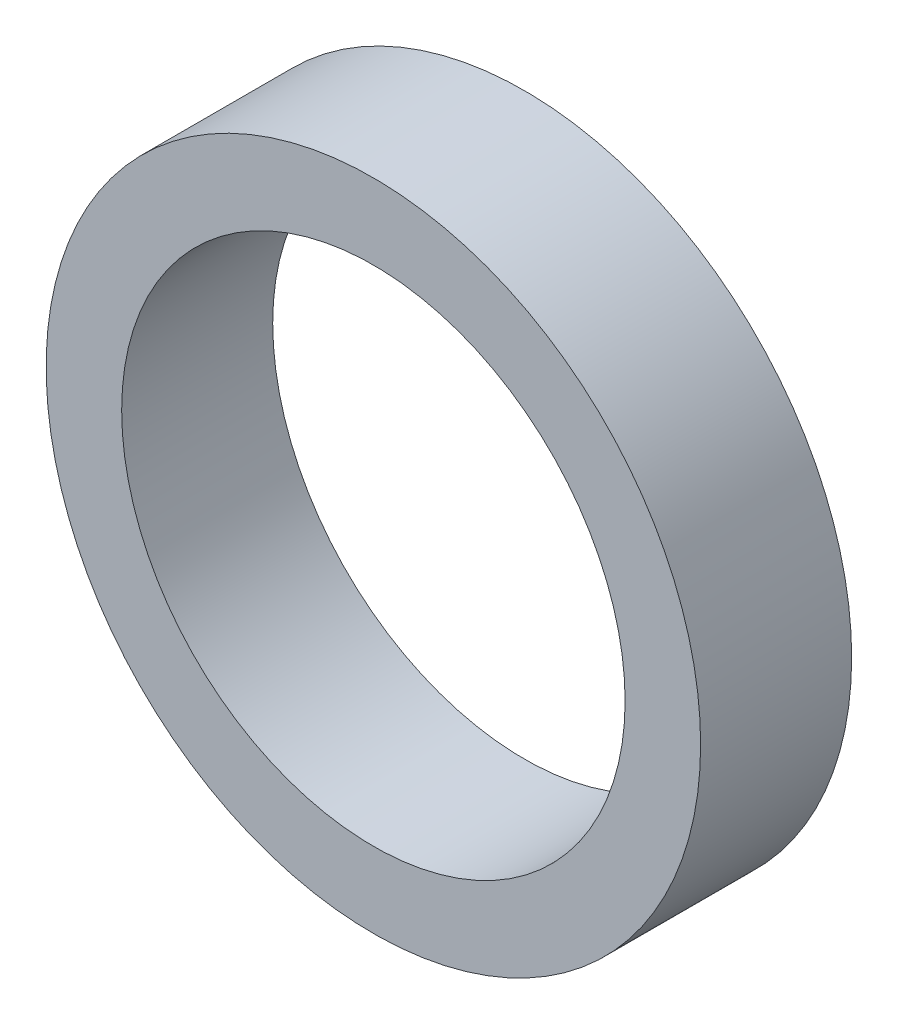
ISO-10303-21;
HEADER;
FILE_DESCRIPTION(('STEP AP214'),'2;1');
FILE_NAME('part.step','',(''),(''),'','','');
FILE_SCHEMA(('AUTOMOTIVE_DESIGN { 1 0 10303 214 1 1 1 1 }'));
ENDSEC;
DATA;
#1=APPLICATION_CONTEXT('core data for automotive mechanical design processes');
#2=APPLICATION_PROTOCOL_DEFINITION('international standard','automotive_design',2000,#1);
#3=PRODUCT_CONTEXT('',#1,'mechanical');
#4=PRODUCT('Part','Part','',(#3));
#5=PRODUCT_RELATED_PRODUCT_CATEGORY('part','',(#4));
#6=PRODUCT_DEFINITION_FORMATION('','',#4);
#7=PRODUCT_DEFINITION_CONTEXT('part definition',#1,'design');
#8=PRODUCT_DEFINITION('design','',#6,#7);
#9=PRODUCT_DEFINITION_SHAPE('','',#8);
#10=(LENGTH_UNIT() NAMED_UNIT(*) SI_UNIT(.MILLI.,.METRE.));
#11=(NAMED_UNIT(*) PLANE_ANGLE_UNIT() SI_UNIT($,.RADIAN.));
#12=(NAMED_UNIT(*) SI_UNIT($,.STERADIAN.) SOLID_ANGLE_UNIT());
#13=UNCERTAINTY_MEASURE_WITH_UNIT(LENGTH_MEASURE(1.E-05),#10,'distance_accuracy_value','');
#14=(GEOMETRIC_REPRESENTATION_CONTEXT(3) GLOBAL_UNCERTAINTY_ASSIGNED_CONTEXT((#13)) GLOBAL_UNIT_ASSIGNED_CONTEXT((#10,
#11,#12)) REPRESENTATION_CONTEXT('',''));
#15=CARTESIAN_POINT('',(0.,0.,0.));
#16=DIRECTION('',(0.,0.,1.));
#17=DIRECTION('',(1.,0.,0.));
#18=AXIS2_PLACEMENT_3D('',#15,#16,#17);
#19=CARTESIAN_POINT('',(0.,0.,-3.));
#20=DIRECTION('',(0.,0.,1.));
#21=DIRECTION('',(1.,0.,0.));
#22=AXIS2_PLACEMENT_3D('',#19,#20,#21);
#23=CYLINDRICAL_SURFACE('',#22,6.5);
#24=CARTESIAN_POINT('',(0.,0.,-3.));
#25=DIRECTION('',(0.,0.,1.));
#26=DIRECTION('',(1.,0.,0.));
#27=AXIS2_PLACEMENT_3D('',#24,#25,#26);
#28=CIRCLE('',#27,6.5);
#29=CARTESIAN_POINT('',(6.50000000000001,0.,-3.));
#30=VERTEX_POINT('',#29);
#31=EDGE_CURVE('E10',#30,#30,#28,.T.);
#32=ORIENTED_EDGE('',*,*,#31,.T.);
#33=EDGE_LOOP('',(#32));
#34=FACE_BOUND('',#33,.T.);
#35=CARTESIAN_POINT('',(0.,0.,0.));
#36=DIRECTION('',(0.,0.,1.));
#37=DIRECTION('',(1.,0.,0.));
#38=AXIS2_PLACEMENT_3D('',#35,#36,#37);
#39=CIRCLE('',#38,6.5);
#40=CARTESIAN_POINT('',(6.50000000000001,0.,0.));
#41=VERTEX_POINT('',#40);
#42=EDGE_CURVE('E32',#41,#41,#39,.T.);
#43=ORIENTED_EDGE('',*,*,#42,.F.);
#44=EDGE_LOOP('',(#43));
#45=FACE_BOUND('',#44,.T.);
#46=ADVANCED_FACE('F26',(#34,#45),#23,.T.);
#47=CARTESIAN_POINT('',(0.,0.,-3.));
#48=DIRECTION('',(0.,0.,1.));
#49=DIRECTION('',(1.,0.,0.));
#50=AXIS2_PLACEMENT_3D('',#47,#48,#49);
#51=PLANE('',#50);
#52=CARTESIAN_POINT('',(0.,0.,-3.));
#53=DIRECTION('',(0.,0.,1.));
#54=DIRECTION('',(1.,0.,0.));
#55=AXIS2_PLACEMENT_3D('',#52,#53,#54);
#56=CIRCLE('',#55,5.);
#57=CARTESIAN_POINT('',(5.00000000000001,0.,-3.));
#58=VERTEX_POINT('',#57);
#59=EDGE_CURVE('E36',#58,#58,#56,.T.);
#60=ORIENTED_EDGE('',*,*,#59,.T.);
#61=EDGE_LOOP('',(#60));
#62=FACE_BOUND('',#61,.T.);
#63=ORIENTED_EDGE('',*,*,#31,.F.);
#64=EDGE_LOOP('',(#63));
#65=FACE_BOUND('',#64,.T.);
#66=ADVANCED_FACE('F50',(#62,#65),#51,.F.);
#67=CARTESIAN_POINT('',(0.,0.,0.));
#68=DIRECTION('',(0.,0.,1.));
#69=DIRECTION('',(1.,0.,0.));
#70=AXIS2_PLACEMENT_3D('',#67,#68,#69);
#71=PLANE('',#70);
#72=CARTESIAN_POINT('',(0.,0.,0.));
#73=DIRECTION('',(0.,0.,1.));
#74=DIRECTION('',(1.,0.,0.));
#75=AXIS2_PLACEMENT_3D('',#72,#73,#74);
#76=CIRCLE('',#75,5.);
#77=CARTESIAN_POINT('',(5.00000000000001,0.,0.));
#78=VERTEX_POINT('',#77);
#79=EDGE_CURVE('E40',#78,#78,#76,.T.);
#80=ORIENTED_EDGE('',*,*,#79,.F.);
#81=EDGE_LOOP('',(#80));
#82=FACE_BOUND('',#81,.T.);
#83=ORIENTED_EDGE('',*,*,#42,.T.);
#84=EDGE_LOOP('',(#83));
#85=FACE_BOUND('',#84,.T.);
#86=ADVANCED_FACE('F48',(#82,#85),#71,.T.);
#87=CARTESIAN_POINT('',(0.,0.,-3.));
#88=DIRECTION('',(0.,0.,1.));
#89=DIRECTION('',(1.,0.,0.));
#90=AXIS2_PLACEMENT_3D('',#87,#88,#89);
#91=CYLINDRICAL_SURFACE('',#90,5.);
#92=ORIENTED_EDGE('',*,*,#59,.F.);
#93=EDGE_LOOP('',(#92));
#94=FACE_BOUND('',#93,.T.);
#95=ORIENTED_EDGE('',*,*,#79,.T.);
#96=EDGE_LOOP('',(#95));
#97=FACE_BOUND('',#96,.T.);
#98=ADVANCED_FACE('F46',(#94,#97),#91,.F.);
#99=CLOSED_SHELL('',(#46,#66,#86,#98));
#100=MANIFOLD_SOLID_BREP('B2',#99);
#101=ADVANCED_BREP_SHAPE_REPRESENTATION('',(#18,#100),#14);
#102=SHAPE_DEFINITION_REPRESENTATION(#9,#101);
ENDSEC;
END-ISO-10303-21;
